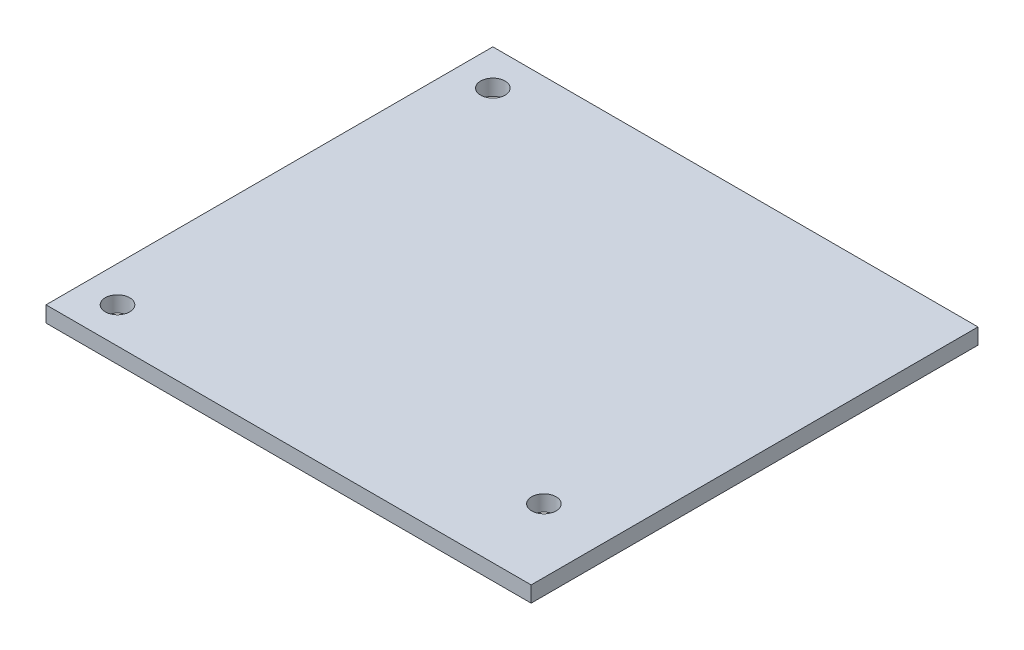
ISO-10303-21;
HEADER;
FILE_DESCRIPTION(('STEP AP214'),'2;1');
FILE_NAME('part.step','',(''),(''),'','','');
FILE_SCHEMA(('AUTOMOTIVE_DESIGN { 1 0 10303 214 1 1 1 1 }'));
ENDSEC;
DATA;
#1=APPLICATION_CONTEXT('core data for automotive mechanical design processes');
#2=APPLICATION_PROTOCOL_DEFINITION('international standard','automotive_design',2000,#1);
#3=PRODUCT_CONTEXT('',#1,'mechanical');
#4=PRODUCT('Part','Part','',(#3));
#5=PRODUCT_RELATED_PRODUCT_CATEGORY('part','',(#4));
#6=PRODUCT_DEFINITION_FORMATION('','',#4);
#7=PRODUCT_DEFINITION_CONTEXT('part definition',#1,'design');
#8=PRODUCT_DEFINITION('design','',#6,#7);
#9=PRODUCT_DEFINITION_SHAPE('','',#8);
#10=(LENGTH_UNIT() NAMED_UNIT(*) SI_UNIT(.MILLI.,.METRE.));
#11=(NAMED_UNIT(*) PLANE_ANGLE_UNIT() SI_UNIT($,.RADIAN.));
#12=(NAMED_UNIT(*) SI_UNIT($,.STERADIAN.) SOLID_ANGLE_UNIT());
#13=UNCERTAINTY_MEASURE_WITH_UNIT(LENGTH_MEASURE(1.E-05),#10,'distance_accuracy_value','');
#14=(GEOMETRIC_REPRESENTATION_CONTEXT(3) GLOBAL_UNCERTAINTY_ASSIGNED_CONTEXT((#13)) GLOBAL_UNIT_ASSIGNED_CONTEXT((#10,
#11,#12)) REPRESENTATION_CONTEXT('',''));
#15=CARTESIAN_POINT('',(0.,0.,0.));
#16=DIRECTION('',(0.,0.,1.));
#17=DIRECTION('',(1.,0.,0.));
#18=AXIS2_PLACEMENT_3D('',#15,#16,#17);
#19=CARTESIAN_POINT('',(0.,1.5748,0.));
#20=DIRECTION('',(0.,-1.,0.));
#21=DIRECTION('',(0.,0.,-1.));
#22=AXIS2_PLACEMENT_3D('',#19,#20,#21);
#23=PLANE('',#22);
#24=DIRECTION('',(0.,0.,1.));
#25=VECTOR('',#24,1.);
#26=CARTESIAN_POINT('',(0.,1.5748,0.));
#27=LINE('',#26,#25);
#28=CARTESIAN_POINT('',(0.,1.5748,-44.45));
#29=VERTEX_POINT('',#28);
#30=CARTESIAN_POINT('',(0.,1.5748,0.));
#31=VERTEX_POINT('',#30);
#32=EDGE_CURVE('E98',#29,#31,#27,.T.);
#33=ORIENTED_EDGE('',*,*,#32,.T.);
#34=DIRECTION('',(1.,0.,0.));
#35=VECTOR('',#34,1.);
#36=CARTESIAN_POINT('',(0.,1.5748,0.));
#37=LINE('',#36,#35);
#38=CARTESIAN_POINT('',(48.26,1.5748,0.));
#39=VERTEX_POINT('',#38);
#40=EDGE_CURVE('E93',#31,#39,#37,.T.);
#41=ORIENTED_EDGE('',*,*,#40,.T.);
#42=DIRECTION('',(0.,0.,-1.));
#43=VECTOR('',#42,1.);
#44=CARTESIAN_POINT('',(48.26,1.5748,0.));
#45=LINE('',#44,#43);
#46=CARTESIAN_POINT('',(48.26,1.5748,-44.45));
#47=VERTEX_POINT('',#46);
#48=EDGE_CURVE('E96',#39,#47,#45,.T.);
#49=ORIENTED_EDGE('',*,*,#48,.T.);
#50=DIRECTION('',(-1.,0.,0.));
#51=VECTOR('',#50,1.);
#52=CARTESIAN_POINT('',(0.,1.5748,-44.45));
#53=LINE('',#52,#51);
#54=EDGE_CURVE('E63',#47,#29,#53,.T.);
#55=ORIENTED_EDGE('',*,*,#54,.T.);
#56=EDGE_LOOP('',(#33,#41,#49,#55));
#57=FACE_BOUND('',#56,.T.);
#58=CARTESIAN_POINT('',(3.556,1.5748,-40.894));
#59=DIRECTION('',(0.,1.,0.));
#60=DIRECTION('',(0.,0.,1.));
#61=AXIS2_PLACEMENT_3D('',#58,#59,#60);
#62=CIRCLE('',#61,1.2192);
#63=CARTESIAN_POINT('',(3.556,1.5748,-39.6748));
#64=VERTEX_POINT('',#63);
#65=EDGE_CURVE('E118',#64,#64,#62,.T.);
#66=ORIENTED_EDGE('',*,*,#65,.F.);
#67=EDGE_LOOP('',(#66));
#68=FACE_BOUND('',#67,.T.);
#69=CARTESIAN_POINT('',(3.556,1.5748,-3.556));
#70=DIRECTION('',(0.,1.,0.));
#71=DIRECTION('',(0.,0.,1.));
#72=AXIS2_PLACEMENT_3D('',#69,#70,#71);
#73=CIRCLE('',#72,1.2192);
#74=CARTESIAN_POINT('',(3.556,1.5748,-2.3368));
#75=VERTEX_POINT('',#74);
#76=EDGE_CURVE('E140',#75,#75,#73,.T.);
#77=ORIENTED_EDGE('',*,*,#76,.F.);
#78=EDGE_LOOP('',(#77));
#79=FACE_BOUND('',#78,.T.);
#80=CARTESIAN_POINT('',(41.91,1.5748,-7.62));
#81=DIRECTION('',(0.,1.,0.));
#82=DIRECTION('',(0.,0.,1.));
#83=AXIS2_PLACEMENT_3D('',#80,#81,#82);
#84=CIRCLE('',#83,1.2192);
#85=CARTESIAN_POINT('',(41.91,1.5748,-6.4008));
#86=VERTEX_POINT('',#85);
#87=EDGE_CURVE('E148',#86,#86,#84,.T.);
#88=ORIENTED_EDGE('',*,*,#87,.F.);
#89=EDGE_LOOP('',(#88));
#90=FACE_BOUND('',#89,.T.);
#91=ADVANCED_FACE('F45',(#57,#68,#79,#90),#23,.F.);
#92=CARTESIAN_POINT('',(0.,0.,0.));
#93=DIRECTION('',(0.,-1.,0.));
#94=DIRECTION('',(0.,0.,-1.));
#95=AXIS2_PLACEMENT_3D('',#92,#93,#94);
#96=PLANE('',#95);
#97=CARTESIAN_POINT('',(3.556,0.,-3.556));
#98=DIRECTION('',(0.,1.,0.));
#99=DIRECTION('',(0.,0.,1.));
#100=AXIS2_PLACEMENT_3D('',#97,#98,#99);
#101=CIRCLE('',#100,1.2192);
#102=CARTESIAN_POINT('',(3.556,0.,-2.3368));
#103=VERTEX_POINT('',#102);
#104=EDGE_CURVE('E144',#103,#103,#101,.T.);
#105=ORIENTED_EDGE('',*,*,#104,.T.);
#106=EDGE_LOOP('',(#105));
#107=FACE_BOUND('',#106,.T.);
#108=DIRECTION('',(0.,0.,1.));
#109=VECTOR('',#108,1.);
#110=CARTESIAN_POINT('',(0.,0.,0.));
#111=LINE('',#110,#109);
#112=CARTESIAN_POINT('',(0.,0.,-44.45));
#113=VERTEX_POINT('',#112);
#114=CARTESIAN_POINT('',(0.,0.,0.));
#115=VERTEX_POINT('',#114);
#116=EDGE_CURVE('E114',#113,#115,#111,.T.);
#117=ORIENTED_EDGE('',*,*,#116,.F.);
#118=DIRECTION('',(-1.,0.,0.));
#119=VECTOR('',#118,1.);
#120=CARTESIAN_POINT('',(0.,0.,-44.45));
#121=LINE('',#120,#119);
#122=CARTESIAN_POINT('',(48.26,0.,-44.45));
#123=VERTEX_POINT('',#122);
#124=EDGE_CURVE('E86',#123,#113,#121,.T.);
#125=ORIENTED_EDGE('',*,*,#124,.F.);
#126=DIRECTION('',(0.,0.,-1.));
#127=VECTOR('',#126,1.);
#128=CARTESIAN_POINT('',(48.26,0.,0.));
#129=LINE('',#128,#127);
#130=CARTESIAN_POINT('',(48.26,0.,0.));
#131=VERTEX_POINT('',#130);
#132=EDGE_CURVE('E80',#131,#123,#129,.T.);
#133=ORIENTED_EDGE('',*,*,#132,.F.);
#134=DIRECTION('',(1.,0.,0.));
#135=VECTOR('',#134,1.);
#136=CARTESIAN_POINT('',(0.,0.,0.));
#137=LINE('',#136,#135);
#138=EDGE_CURVE('E103',#115,#131,#137,.T.);
#139=ORIENTED_EDGE('',*,*,#138,.F.);
#140=EDGE_LOOP('',(#117,#125,#133,#139));
#141=FACE_BOUND('',#140,.T.);
#142=CARTESIAN_POINT('',(3.556,0.,-40.894));
#143=DIRECTION('',(0.,1.,0.));
#144=DIRECTION('',(0.,0.,1.));
#145=AXIS2_PLACEMENT_3D('',#142,#143,#144);
#146=CIRCLE('',#145,1.2192);
#147=CARTESIAN_POINT('',(3.556,0.,-39.6748));
#148=VERTEX_POINT('',#147);
#149=EDGE_CURVE('E136',#148,#148,#146,.T.);
#150=ORIENTED_EDGE('',*,*,#149,.T.);
#151=EDGE_LOOP('',(#150));
#152=FACE_BOUND('',#151,.T.);
#153=CARTESIAN_POINT('',(41.91,0.,-7.62));
#154=DIRECTION('',(0.,1.,0.));
#155=DIRECTION('',(0.,0.,1.));
#156=AXIS2_PLACEMENT_3D('',#153,#154,#155);
#157=CIRCLE('',#156,1.2192);
#158=CARTESIAN_POINT('',(41.91,0.,-6.4008));
#159=VERTEX_POINT('',#158);
#160=EDGE_CURVE('E152',#159,#159,#157,.T.);
#161=ORIENTED_EDGE('',*,*,#160,.T.);
#162=EDGE_LOOP('',(#161));
#163=FACE_BOUND('',#162,.T.);
#164=ADVANCED_FACE('F131',(#107,#141,#152,#163),#96,.T.);
#165=CARTESIAN_POINT('',(0.,1.5748,0.));
#166=DIRECTION('',(1.,0.,0.));
#167=DIRECTION('',(0.,0.,-1.));
#168=AXIS2_PLACEMENT_3D('',#165,#166,#167);
#169=PLANE('',#168);
#170=ORIENTED_EDGE('',*,*,#116,.T.);
#171=DIRECTION('',(0.,-1.,0.));
#172=VECTOR('',#171,1.);
#173=CARTESIAN_POINT('',(0.,1.5748,0.));
#174=LINE('',#173,#172);
#175=EDGE_CURVE('E11',#31,#115,#174,.T.);
#176=ORIENTED_EDGE('',*,*,#175,.F.);
#177=ORIENTED_EDGE('',*,*,#32,.F.);
#178=DIRECTION('',(0.,-1.,0.));
#179=VECTOR('',#178,1.);
#180=CARTESIAN_POINT('',(0.,1.5748,-44.45));
#181=LINE('',#180,#179);
#182=EDGE_CURVE('E110',#29,#113,#181,.T.);
#183=ORIENTED_EDGE('',*,*,#182,.T.);
#184=EDGE_LOOP('',(#170,#176,#177,#183));
#185=FACE_BOUND('',#184,.T.);
#186=ADVANCED_FACE('F47',(#185),#169,.F.);
#187=CARTESIAN_POINT('',(0.,1.5748,0.));
#188=DIRECTION('',(0.,0.,-1.));
#189=DIRECTION('',(-1.,0.,0.));
#190=AXIS2_PLACEMENT_3D('',#187,#188,#189);
#191=PLANE('',#190);
#192=ORIENTED_EDGE('',*,*,#138,.T.);
#193=DIRECTION('',(0.,-1.,0.));
#194=VECTOR('',#193,1.);
#195=CARTESIAN_POINT('',(48.26,1.5748,0.));
#196=LINE('',#195,#194);
#197=EDGE_CURVE('E55',#39,#131,#196,.T.);
#198=ORIENTED_EDGE('',*,*,#197,.F.);
#199=ORIENTED_EDGE('',*,*,#40,.F.);
#200=ORIENTED_EDGE('',*,*,#175,.T.);
#201=EDGE_LOOP('',(#192,#198,#199,#200));
#202=FACE_BOUND('',#201,.T.);
#203=ADVANCED_FACE('F102',(#202),#191,.F.);
#204=CARTESIAN_POINT('',(48.26,1.5748,0.));
#205=DIRECTION('',(-1.,0.,0.));
#206=DIRECTION('',(0.,0.,1.));
#207=AXIS2_PLACEMENT_3D('',#204,#205,#206);
#208=PLANE('',#207);
#209=ORIENTED_EDGE('',*,*,#132,.T.);
#210=DIRECTION('',(0.,-1.,0.));
#211=VECTOR('',#210,1.);
#212=CARTESIAN_POINT('',(48.26,1.5748,-44.45));
#213=LINE('',#212,#211);
#214=EDGE_CURVE('E105',#47,#123,#213,.T.);
#215=ORIENTED_EDGE('',*,*,#214,.F.);
#216=ORIENTED_EDGE('',*,*,#48,.F.);
#217=ORIENTED_EDGE('',*,*,#197,.T.);
#218=EDGE_LOOP('',(#209,#215,#216,#217));
#219=FACE_BOUND('',#218,.T.);
#220=ADVANCED_FACE('F106',(#219),#208,.F.);
#221=CARTESIAN_POINT('',(0.,1.5748,-44.45));
#222=DIRECTION('',(0.,0.,1.));
#223=DIRECTION('',(1.,0.,0.));
#224=AXIS2_PLACEMENT_3D('',#221,#222,#223);
#225=PLANE('',#224);
#226=ORIENTED_EDGE('',*,*,#124,.T.);
#227=ORIENTED_EDGE('',*,*,#182,.F.);
#228=ORIENTED_EDGE('',*,*,#54,.F.);
#229=ORIENTED_EDGE('',*,*,#214,.T.);
#230=EDGE_LOOP('',(#226,#227,#228,#229));
#231=FACE_BOUND('',#230,.T.);
#232=ADVANCED_FACE('F128',(#231),#225,.F.);
#233=CARTESIAN_POINT('',(3.556,1.5748,-40.894));
#234=DIRECTION('',(0.,-1.,0.));
#235=DIRECTION('',(0.,0.,-1.));
#236=AXIS2_PLACEMENT_3D('',#233,#234,#235);
#237=CYLINDRICAL_SURFACE('',#236,1.2192);
#238=ORIENTED_EDGE('',*,*,#65,.T.);
#239=EDGE_LOOP('',(#238));
#240=FACE_BOUND('',#239,.T.);
#241=ORIENTED_EDGE('',*,*,#149,.F.);
#242=EDGE_LOOP('',(#241));
#243=FACE_BOUND('',#242,.T.);
#244=ADVANCED_FACE('F171',(#240,#243),#237,.F.);
#245=CARTESIAN_POINT('',(3.556,1.5748,-3.556));
#246=DIRECTION('',(0.,-1.,0.));
#247=DIRECTION('',(0.,0.,-1.));
#248=AXIS2_PLACEMENT_3D('',#245,#246,#247);
#249=CYLINDRICAL_SURFACE('',#248,1.2192);
#250=ORIENTED_EDGE('',*,*,#76,.T.);
#251=EDGE_LOOP('',(#250));
#252=FACE_BOUND('',#251,.T.);
#253=ORIENTED_EDGE('',*,*,#104,.F.);
#254=EDGE_LOOP('',(#253));
#255=FACE_BOUND('',#254,.T.);
#256=ADVANCED_FACE('F216',(#252,#255),#249,.F.);
#257=CARTESIAN_POINT('',(41.91,1.5748,-7.62));
#258=DIRECTION('',(0.,-1.,0.));
#259=DIRECTION('',(0.,0.,-1.));
#260=AXIS2_PLACEMENT_3D('',#257,#258,#259);
#261=CYLINDRICAL_SURFACE('',#260,1.2192);
#262=ORIENTED_EDGE('',*,*,#87,.T.);
#263=EDGE_LOOP('',(#262));
#264=FACE_BOUND('',#263,.T.);
#265=ORIENTED_EDGE('',*,*,#160,.F.);
#266=EDGE_LOOP('',(#265));
#267=FACE_BOUND('',#266,.T.);
#268=ADVANCED_FACE('F160',(#264,#267),#261,.F.);
#269=CLOSED_SHELL('',(#91,#164,#186,#203,#220,#232,#244,#256,#268));
#270=MANIFOLD_SOLID_BREP('B2',#269);
#271=ADVANCED_BREP_SHAPE_REPRESENTATION('',(#18,#270),#14);
#272=SHAPE_DEFINITION_REPRESENTATION(#9,#271);
ENDSEC;
END-ISO-10303-21;
